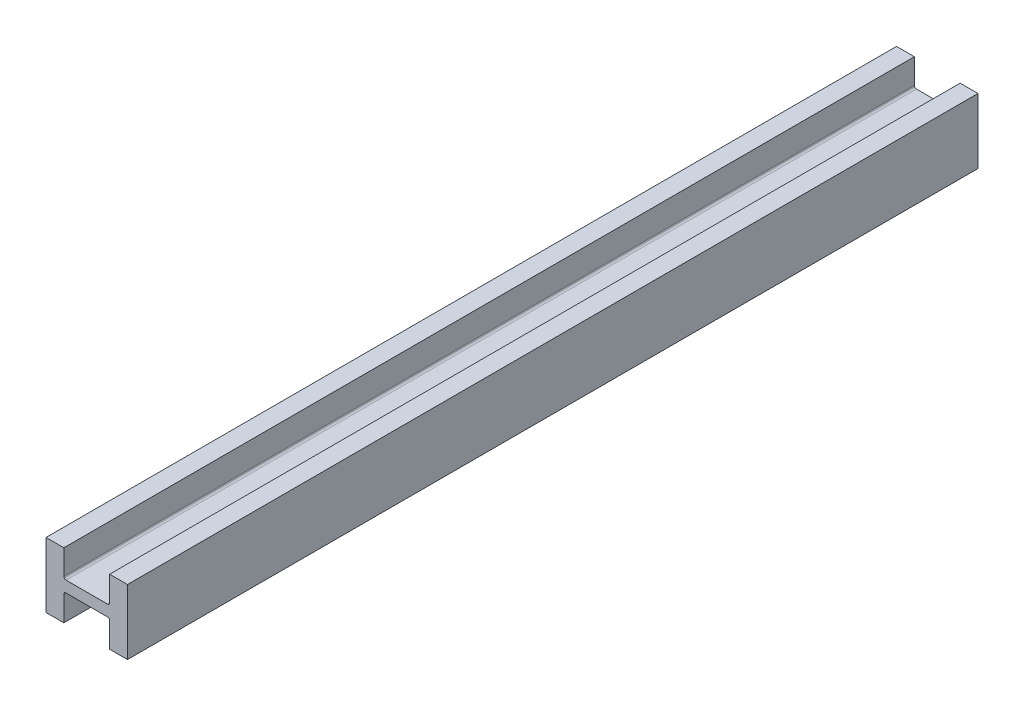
from build123d import *

# Parameters (mm, degrees)
BEAM_BODY_DEPTH = 2971.8


with BuildPart() as part:
    # sk W14x730 → Beam Body (new, symmetric)
    with BuildSketch(Plane(origin=(0, 0, 0), x_dir=(0, 1, 0), z_dir=(0, 0, 1))):
        with BuildLine():
            Line((-227.203, -284.734), (-227.203, -160.02))
            Line((-227.203, -160.02), (-54.229, -160.02))
            ThreePointArc((-54.229, -160.02), (-43.452692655, -155.556307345), (-38.989, -144.78))
            Line((-38.989, -144.78), (-38.989, 144.78))
            ThreePointArc((-38.989, 144.78), (-43.452692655, 155.556307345), (-54.229, 160.02))
            Line((-54.229, 160.02), (-227.203, 160.02))
            Line((-227.203, 160.02), (-227.203, 284.734))
            Line((-227.203, 284.734), (227.203, 284.734))
            Line((227.203, 284.734), (227.203, 160.02))
            Line((227.203, 160.02), (54.229, 160.02))
            ThreePointArc((54.229, 160.02), (43.452692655, 155.556307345), (38.989, 144.78))
            Line((38.989, 144.78), (38.989, -144.78))
            ThreePointArc((38.989, -144.78), (43.452692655, -155.556307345), (54.229, -160.02))
            Line((54.229, -160.02), (227.203, -160.02))
            Line((227.203, -160.02), (227.203, -284.734))
            Line((227.203, -284.734), (-227.203, -284.734))
        make_face()
    extrude(amount=BEAM_BODY_DEPTH, both=True)


solid = part.part
